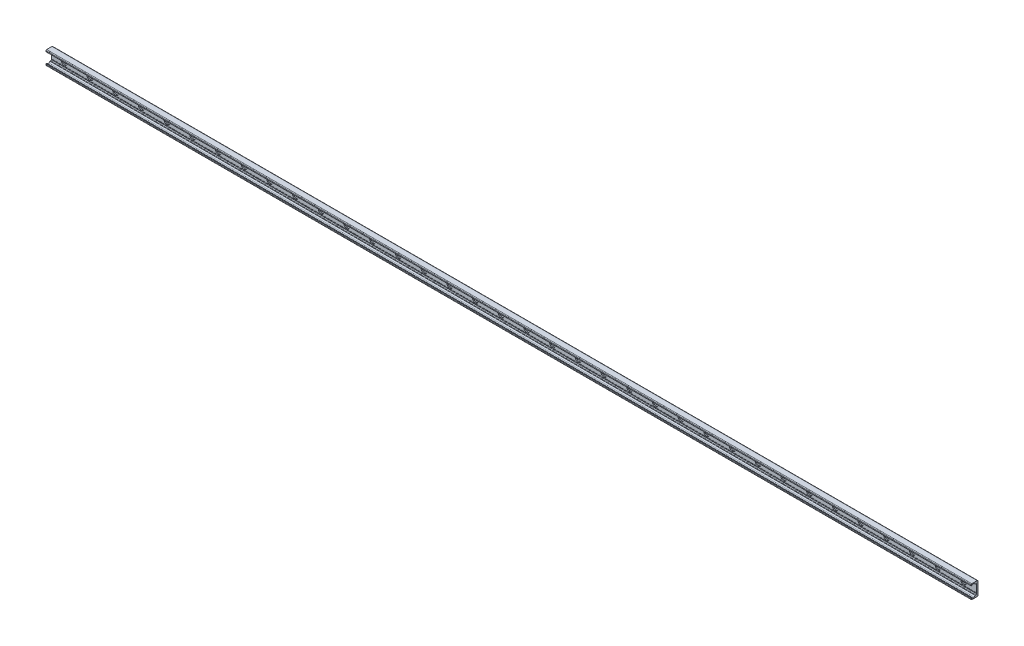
from build123d import *

# Parameters (mm, degrees)
BOSS_EXTRUDE1_DEPTH = 1440
SKETCH2_R           = 9
SKETCH2_R_2         = 4.5
CUT_EXTRUDE1_DEPTH  = 3.1
SKETCH2_2_R         = 4.5
CUT_EXTRUDE2_DEPTH  = 1441.255012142
LPATTERN1_COUNT     = 36
LPATTERN1_PITCH     = 80


with BuildPart() as part:
    # Sketch1 → Boss-Extrude1 (new, symmetric)
    with BuildSketch(Plane(origin=(0, 0, 0), x_dir=(0, 0, -1), z_dir=(1, 0, 0))):
        with BuildLine():
            Line((0, 0), (0, 19))
            ThreePointArc((0, 19), (-0.732233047, 20.767766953), (-2.5, 21.5))
            Line((-2.5, 21.5), (-19, 21.5))
            ThreePointArc((-19, 21.5), (-20.414213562, 20.914213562), (-21, 19.5))
            Line((-21, 19.5), (-21, 16.625057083))
            ThreePointArc((-21, 16.625057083), (-20.553251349, 15.888838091), (-19.693931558, 15.945160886))
            Line((-19.693931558, 15.945160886), (-16.794305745, 17.975500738))
            ThreePointArc((-16.794305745, 17.975500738), (-14.5, 18.69889256), (-12.205694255, 17.975500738))
            Line((-12.205694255, 17.975500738), (-8.829831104, 15.611695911))
            ThreePointArc((-8.829831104, 15.611695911), (-8.28408983, 15.342566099), (-7.682678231, 15.25))
            Line((-7.682678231, 15.25), (-6.5, 15.25))
            ThreePointArc((-6.5, 15.25), (-5.085786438, 14.664213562), (-4.5, 13.25))
            Line((-4.5, 13.25), (-4.5, -10.75))
            ThreePointArc((-4.5, -10.75), (-4.25, -11), (-4.5, -11.25))
            Line((-4.5, -11.25), (-4.5, -12.25))
            ThreePointArc((-4.5, -12.25), (-4.25, -12.5), (-4.5, -12.75))
            Line((-4.5, -12.75), (-4.5, -13.25))
            ThreePointArc((-4.5, -13.25), (-5.085786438, -14.664213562), (-6.5, -15.25))
            Line((-6.5, -15.25), (-7.682678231, -15.25))
            ThreePointArc((-7.682678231, -15.25), (-8.28408983, -15.342566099), (-8.829831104, -15.611695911))
            Line((-8.829831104, -15.611695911), (-12.205694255, -17.975500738))
            ThreePointArc((-12.205694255, -17.975500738), (-14.5, -18.69889256), (-16.794305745, -17.975500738))
            Line((-16.794305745, -17.975500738), (-19.693931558, -15.945160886))
            ThreePointArc((-19.693931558, -15.945160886), (-20.553251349, -15.888838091), (-21, -16.625057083))
            Line((-21, -16.625057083), (-21, -19.5))
            ThreePointArc((-21, -19.5), (-20.414213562, -20.914213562), (-19, -21.5))
            Line((-19, -21.5), (-2.5, -21.5))
            ThreePointArc((-2.5, -21.5), (-0.732233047, -20.767766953), (0, -19))
            Line((0, -19), (0, 0))
        make_face()
    extrude(amount=BOSS_EXTRUDE1_DEPTH, both=True)

    # Sketch2 → Cut-Extrude1 (cut)
    with BuildSketch(Plane.XY.offset(4.5)):
        with Locations((1400, 0)):
            Circle(SKETCH2_R)
        with Locations((1400, 0)):
            Circle(SKETCH2_R_2, mode=Mode.SUBTRACT)
    cut_extrude1 = extrude(amount=-CUT_EXTRUDE1_DEPTH, mode=Mode.SUBTRACT)

    # Sketch2_2 → Cut-Extrude2 (cut, through all)
    with BuildSketch(Plane.XY.offset(4.5)):
        with Locations((1400, 0)):
            Circle(SKETCH2_2_R)
    cut_extrude2 = extrude(amount=-CUT_EXTRUDE2_DEPTH, mode=Mode.SUBTRACT)

    # LPattern1: Cut-Extrude1, Cut-Extrude2 ×36
    with Locations(*[(-i * LPATTERN1_PITCH, 0, 0) for i in range(1, LPATTERN1_COUNT)]):
        add(cut_extrude1, mode=Mode.SUBTRACT)
        add(cut_extrude2, mode=Mode.SUBTRACT)


solid = part.part
